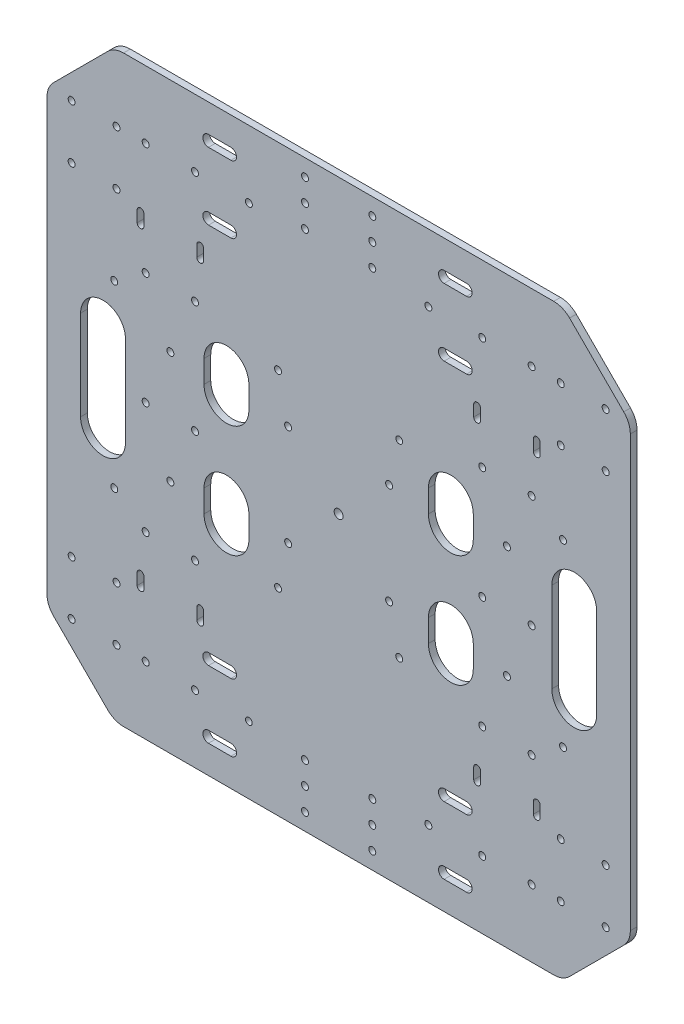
from build123d import *

# Parameters (mm, degrees)
SKETCH_1_R               = 2
EXTRUDE_1_DEPTH          = 3
SKETCH_3_R               = 1.55
SKETCH_3_R_2             = 1.5
CUT_EXTRUDE_2603_DEPTH   = 184.872238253
SKETCH_5_R               = 1.55
SKETCH_5_R_2             = 1.5
CUT_EXTRUDE_3632_DEPTH   = 184.872238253
SKETCH_6_R               = 1.55
CUT_EXTRUDE_4990_DEPTH   = 184.872238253
CUT_EXTRUDE_6221_DEPTH   = 184.872238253
FILLET_1_R               = 10
SKETCH_10_R              = 1.55
CUT_EXTRUDE_1_DEPTH      = 184.872238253
MIRROR_2_COPY_1_SKETCH_R = 1.55
MIRROR_2_COPY_1_DEPTH    = 184.872238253
CUT_EXTRUDE_2_DEPTH      = 184.872238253
CUT_EXTRUDE_3_DEPTH      = 184.872238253


with BuildPart() as part:
    # Sketch 1 → Extrude 1 (new body)
    with BuildSketch(Plane.XY):
        Polygon((-130, 100), (-100, 130), (100, 130), (130, 100), (130, -100), (100, -130), (-100, -130), (-130, -100), align=None)
        Circle(SKETCH_1_R, mode=Mode.SUBTRACT)
    extrude(amount=EXTRUDE_1_DEPTH)

    # Sketch 3 → Cut-Extrude 2603 (cut, through all)
    with BuildSketch(Plane.XY.offset(3)):
        with Locations((-86, 100)):
            Circle(SKETCH_3_R)
        with Locations((-64, 100)):
            Circle(SKETCH_3_R)
        with Locations((64, 100)):
            Circle(SKETCH_3_R)
        with Locations((86, 100)):
            Circle(SKETCH_3_R)
        with Locations((-86, -100)):
            Circle(SKETCH_3_R)
        with Locations((-64, -100)):
            Circle(SKETCH_3_R)
        with Locations((64, -100)):
            Circle(SKETCH_3_R)
        with Locations((86, -100)):
            Circle(SKETCH_3_R)
        with Locations((-40, 100)):
            Circle(SKETCH_3_R)
        with Locations((40, 100)):
            Circle(SKETCH_3_R)
        with Locations((100, 40)):
            Circle(SKETCH_3_R)
        with Locations((100, -40)):
            Circle(SKETCH_3_R)
        with Locations((40, -100)):
            Circle(SKETCH_3_R)
        with Locations((-40, -100)):
            Circle(SKETCH_3_R_2)
        with Locations((-100, -40)):
            Circle(SKETCH_3_R)
        with Locations((-100, 40)):
            Circle(SKETCH_3_R)
        with Locations((-86, 50)):
            Circle(SKETCH_3_R)
        with Locations((-64, 50)):
            Circle(SKETCH_3_R)
        with Locations((-86, -50)):
            Circle(SKETCH_3_R)
        with Locations((-64, -50)):
            Circle(SKETCH_3_R)
        with Locations((-86, 0)):
            Circle(SKETCH_3_R)
        with Locations((-64, 0)):
            Circle(SKETCH_3_R)
        with Locations((64, 50)):
            Circle(SKETCH_3_R)
        with Locations((86, 50)):
            Circle(SKETCH_3_R)
        with Locations((64, 0)):
            Circle(SKETCH_3_R)
        with Locations((86, 0)):
            Circle(SKETCH_3_R)
        with Locations((64, -50)):
            Circle(SKETCH_3_R)
        with Locations((86, -50)):
            Circle(SKETCH_3_R)
        with Locations((-75, 25)):
            Circle(SKETCH_3_R)
        with Locations((-75, -25)):
            Circle(SKETCH_3_R)
        with Locations((75, -25)):
            Circle(SKETCH_3_R)
        with Locations((75, 25)):
            Circle(SKETCH_3_R)
    extrude(amount=-CUT_EXTRUDE_2603_DEPTH, mode=Mode.SUBTRACT)

    # Sketch 5 → Cut-Extrude 3632 (cut, through all)
    with BuildSketch(Plane.XY.offset(3)):
        with Locations((-27, 42)):
            Circle(SKETCH_5_R)
        with Locations((-22.5, 22.5)):
            Circle(SKETCH_5_R)
        with Locations((27, 42)):
            Circle(SKETCH_5_R_2)
        with Locations((22.5, 22.5)):
            Circle(SKETCH_5_R)
        with Locations((-22.5, -22.5)):
            Circle(SKETCH_5_R)
        with Locations((22.5, -22.5)):
            Circle(SKETCH_5_R)
        with Locations((27, -42)):
            Circle(SKETCH_5_R)
        with Locations((-27, -42)):
            Circle(SKETCH_5_R)
    extrude(amount=-CUT_EXTRUDE_3632_DEPTH, mode=Mode.SUBTRACT)

    # Sketch 6 → Cut-Extrude 4990 (cut, through all)
    with BuildSketch(Plane.XY.offset(3)):
        with Locations((-15, 122.5)):
            Circle(SKETCH_6_R)
        with Locations((15, 122.5)):
            Circle(SKETCH_6_R)
        with Locations((-15, 112.5)):
            Circle(SKETCH_6_R)
        with Locations((15, 112.5)):
            Circle(SKETCH_6_R)
        with Locations((-15, -112.5)):
            Circle(SKETCH_6_R)
        with Locations((15, -112.5)):
            Circle(SKETCH_6_R)
        with Locations((-15, -122.5)):
            Circle(SKETCH_6_R)
        with Locations((15, -122.5)):
            Circle(SKETCH_6_R)
        with Locations((-15, 102.5)):
            Circle(SKETCH_6_R)
        with Locations((15, 102.5)):
            Circle(SKETCH_6_R)
        with Locations((-15, -102.5)):
            Circle(SKETCH_6_R)
        with Locations((15, -102.5)):
            Circle(SKETCH_6_R)
    extrude(amount=-CUT_EXTRUDE_4990_DEPTH, mode=Mode.SUBTRACT)

    # Sketch 8 → Cut-Extrude 6221 (cut, through all)
    with BuildSketch(Plane.XY.offset(3)):
        with BuildLine():
            Line((-60, 30), (-60, 20))
            ThreePointArc((-60, 20), (-50, 10), (-40, 20))
            Line((-40, 20), (-40, 30))
            ThreePointArc((-40, 30), (-50, 40), (-60, 30))
        make_face()
        with BuildLine():
            Line((40, 30), (40, 20))
            ThreePointArc((40, 20), (50, 10), (60, 20))
            Line((60, 20), (60, 30))
            ThreePointArc((60, 30), (50, 40), (40, 30))
        make_face()
        with BuildLine():
            Line((40, -20), (40, -30))
            ThreePointArc((40, -30), (50, -40), (60, -30))
            Line((60, -30), (60, -20))
            ThreePointArc((60, -20), (50, -10), (40, -20))
        make_face()
        with BuildLine():
            Line((-60, -20), (-60, -30))
            ThreePointArc((-60, -30), (-50, -40), (-40, -30))
            Line((-40, -30), (-40, -20))
            ThreePointArc((-40, -20), (-50, -10), (-60, -20))
        make_face()
        with BuildLine():
            Line((-95, -20), (-95, 20))
            ThreePointArc((-95, 20), (-105, 30), (-115, 20))
            Line((-115, 20), (-115, -20))
            ThreePointArc((-115, -20), (-105, -30), (-95, -20))
        make_face()
        with BuildLine():
            ThreePointArc((115, 20), (105, 30), (95, 20))
            Line((95, 20), (95, -20))
            ThreePointArc((95, -20), (105, -30), (115, -20))
            Line((115, -20), (115, 20))
        make_face()
    extrude(amount=-CUT_EXTRUDE_6221_DEPTH, mode=Mode.SUBTRACT)

    # Fillet 1
    fillet_1_edges = [part.edges().sort_by_distance(p)[0] for p in [
        (-130, 100, 1.5),
        (-100, 130, 1.5),
        (100, 130, 1.5),
        (130, 100, 1.5),
        (130, -100, 1.5),
        (100, -130, 1.5),
        (-100, -130, 1.5),
        (-130, -100, 1.5),
    ]]
    fillet(fillet_1_edges, radius=FILLET_1_R)

    # Sketch 10 → Cut-Extrude 1 (cut, through all)
    with BuildSketch(Plane(origin=(0, 0, 0), x_dir=(-1, 0, 0), z_dir=(0, 0, -1))):
        with Locations((-119, 100)):
            Circle(SKETCH_10_R)
        with Locations((-99, 100)):
            Circle(SKETCH_10_R)
        with Locations((-119, 76)):
            Circle(SKETCH_10_R)
        with Locations((-99, 76)):
            Circle(SKETCH_10_R)
    cut_extrude_1 = extrude(amount=-CUT_EXTRUDE_1_DEPTH, mode=Mode.SUBTRACT)

    # Mirror 1: Cut-Extrude 1 across plane
    add(cut_extrude_1.mirror(Plane(origin=(0, 0, 0), x_dir=(0, 0, 1), z_dir=(1, 0, 0))), mode=Mode.SUBTRACT)

    # Mirror 2: Cut-Extrude 1 across plane
    add(cut_extrude_1.mirror(Plane.ZX), mode=Mode.SUBTRACT)

    # Mirror 2 copy 1 sketch → Mirror 2 copy 1 (cut, through all)
    with BuildSketch(Plane(origin=(0, 0, 0), x_dir=(1, 0, 0), z_dir=(0, 0, -1))):
        with Locations((-119, 100)):
            Circle(MIRROR_2_COPY_1_SKETCH_R)
        with Locations((-99, 100)):
            Circle(MIRROR_2_COPY_1_SKETCH_R)
        with Locations((-119, 76)):
            Circle(MIRROR_2_COPY_1_SKETCH_R)
        with Locations((-99, 76)):
            Circle(MIRROR_2_COPY_1_SKETCH_R)
    extrude(amount=-MIRROR_2_COPY_1_DEPTH, mode=Mode.SUBTRACT)

    # Sketch 11 → Cut-Extrude 2 (cut, through all)
    with BuildSketch(Plane(origin=(0, 0, 0), x_dir=(-1, 0, 0), z_dir=(0, 0, -1))):
        with BuildLine():
            Line((-86.791618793, 72.5), (-86.791618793, 67.5))
            ThreePointArc((-86.791618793, 67.5), (-88.291618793, 66), (-89.791618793, 67.5))
            Line((-89.791618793, 67.5), (-89.791618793, 72.5))
            ThreePointArc((-89.791618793, 72.5), (-88.291618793, 74), (-86.791618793, 72.5))
        make_face()
        with BuildLine():
            Line((-60.208381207, 72.5), (-60.208381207, 67.5))
            ThreePointArc((-60.208381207, 67.5), (-61.708381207, 66), (-63.208381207, 67.5))
            Line((-63.208381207, 67.5), (-63.208381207, 72.5))
            ThreePointArc((-63.208381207, 72.5), (-61.708381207, 74), (-60.208381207, 72.5))
        make_face()
        with BuildLine():
            Line((60.208381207, 72.5), (60.208381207, 67.5))
            ThreePointArc((60.208381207, 67.5), (61.708381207, 66), (63.208381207, 67.5))
            Line((63.208381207, 67.5), (63.208381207, 72.5))
            ThreePointArc((63.208381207, 72.5), (61.708381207, 74), (60.208381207, 72.5))
        make_face()
        with BuildLine():
            Line((86.791618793, 72.5), (86.791618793, 67.5))
            ThreePointArc((86.791618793, 67.5), (88.291618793, 66), (89.791618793, 67.5))
            Line((89.791618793, 67.5), (89.791618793, 72.5))
            ThreePointArc((89.791618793, 72.5), (88.291618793, 74), (86.791618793, 72.5))
        make_face()
        with BuildLine():
            Line((-86.791618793, -72.5), (-86.791618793, -67.5))
            ThreePointArc((-86.791618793, -67.5), (-88.291618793, -66), (-89.791618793, -67.5))
            Line((-89.791618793, -67.5), (-89.791618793, -72.5))
            ThreePointArc((-89.791618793, -72.5), (-88.291618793, -74), (-86.791618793, -72.5))
        make_face()
        with BuildLine():
            Line((-60.208381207, -72.5), (-60.208381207, -67.5))
            ThreePointArc((-60.208381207, -67.5), (-61.708381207, -66), (-63.208381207, -67.5))
            Line((-63.208381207, -67.5), (-63.208381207, -72.5))
            ThreePointArc((-63.208381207, -72.5), (-61.708381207, -74), (-60.208381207, -72.5))
        make_face()
        with BuildLine():
            Line((60.208381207, -72.5), (60.208381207, -67.5))
            ThreePointArc((60.208381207, -67.5), (61.708381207, -66), (63.208381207, -67.5))
            Line((63.208381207, -67.5), (63.208381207, -72.5))
            ThreePointArc((63.208381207, -72.5), (61.708381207, -74), (60.208381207, -72.5))
        make_face()
        with BuildLine():
            Line((86.791618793, -72.5), (86.791618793, -67.5))
            ThreePointArc((86.791618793, -67.5), (88.291618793, -66), (89.791618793, -67.5))
            Line((89.791618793, -67.5), (89.791618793, -72.5))
            ThreePointArc((89.791618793, -72.5), (88.291618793, -74), (86.791618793, -72.5))
        make_face()
    extrude(amount=-CUT_EXTRUDE_2_DEPTH, mode=Mode.SUBTRACT)

    # Sketch 12 → Cut-Extrude 3 (cut, through all)
    with BuildSketch(Plane(origin=(0, 0, 0), x_dir=(-1, 0, 0), z_dir=(0, 0, -1))):
        with BuildLine():
            Line((-57, 117.5), (-47, 117.5))
            ThreePointArc((-47, 117.5), (-44.5, 115), (-47, 112.5))
            Line((-47, 112.5), (-57, 112.5))
            ThreePointArc((-57, 112.5), (-59.5, 115), (-57, 117.5))
        make_face()
        with BuildLine():
            Line((48, 117.5), (58, 117.5))
            ThreePointArc((58, 117.5), (60.5, 115), (58, 112.5))
            Line((58, 112.5), (48, 112.5))
            ThreePointArc((48, 112.5), (45.5, 115), (48, 117.5))
        make_face()
        with BuildLine():
            Line((48, 87.5), (58, 87.5))
            ThreePointArc((58, 87.5), (60.5, 85), (58, 82.5))
            Line((58, 82.5), (48, 82.5))
            ThreePointArc((48, 82.5), (45.5, 85), (48, 87.5))
        make_face()
        with BuildLine():
            Line((-57, 87.5), (-47, 87.5))
            ThreePointArc((-47, 87.5), (-44.5, 85), (-47, 82.5))
            Line((-47, 82.5), (-57, 82.5))
            ThreePointArc((-57, 82.5), (-59.5, 85), (-57, 87.5))
        make_face()
        with BuildLine():
            Line((-57, -82.5), (-47, -82.5))
            ThreePointArc((-47, -82.5), (-44.5, -85), (-47, -87.5))
            Line((-47, -87.5), (-57, -87.5))
            ThreePointArc((-57, -87.5), (-59.5, -85), (-57, -82.5))
        make_face()
        with BuildLine():
            Line((48, -82.5), (58, -82.5))
            ThreePointArc((58, -82.5), (60.5, -85), (58, -87.5))
            Line((58, -87.5), (48, -87.5))
            ThreePointArc((48, -87.5), (45.5, -85), (48, -82.5))
        make_face()
        with BuildLine():
            Line((48, -112.5), (58, -112.5))
            ThreePointArc((58, -112.5), (60.5, -115), (58, -117.5))
            Line((58, -117.5), (48, -117.5))
            ThreePointArc((48, -117.5), (45.5, -115), (48, -112.5))
        make_face()
        with BuildLine():
            Line((-57, -112.5), (-47, -112.5))
            ThreePointArc((-47, -112.5), (-44.5, -115), (-47, -117.5))
            Line((-47, -117.5), (-57, -117.5))
            ThreePointArc((-57, -117.5), (-59.5, -115), (-57, -112.5))
        make_face()
    extrude(amount=-CUT_EXTRUDE_3_DEPTH, mode=Mode.SUBTRACT)


solid = part.part
